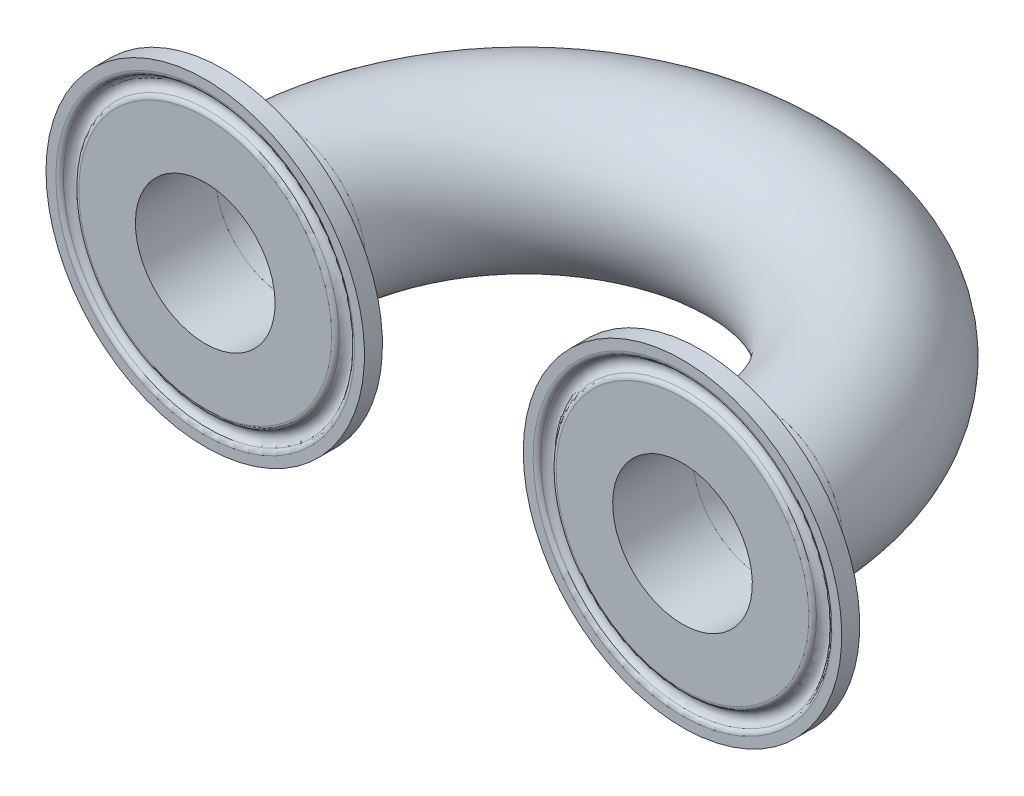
ISO-10303-21;
HEADER;
FILE_DESCRIPTION(('STEP AP214'),'2;1');
FILE_NAME('part.step','',(''),(''),'','','');
FILE_SCHEMA(('AUTOMOTIVE_DESIGN { 1 0 10303 214 1 1 1 1 }'));
ENDSEC;
DATA;
#1=APPLICATION_CONTEXT('core data for automotive mechanical design processes');
#2=APPLICATION_PROTOCOL_DEFINITION('international standard','automotive_design',2000,#1);
#3=PRODUCT_CONTEXT('',#1,'mechanical');
#4=PRODUCT('Part','Part','',(#3));
#5=PRODUCT_RELATED_PRODUCT_CATEGORY('part','',(#4));
#6=PRODUCT_DEFINITION_FORMATION('','',#4);
#7=PRODUCT_DEFINITION_CONTEXT('part definition',#1,'design');
#8=PRODUCT_DEFINITION('design','',#6,#7);
#9=PRODUCT_DEFINITION_SHAPE('','',#8);
#10=(LENGTH_UNIT() NAMED_UNIT(*) SI_UNIT(.MILLI.,.METRE.));
#11=(NAMED_UNIT(*) PLANE_ANGLE_UNIT() SI_UNIT($,.RADIAN.));
#12=(NAMED_UNIT(*) SI_UNIT($,.STERADIAN.) SOLID_ANGLE_UNIT());
#13=UNCERTAINTY_MEASURE_WITH_UNIT(LENGTH_MEASURE(1.E-05),#10,'distance_accuracy_value','');
#14=(GEOMETRIC_REPRESENTATION_CONTEXT(3) GLOBAL_UNCERTAINTY_ASSIGNED_CONTEXT((#13)) GLOBAL_UNIT_ASSIGNED_CONTEXT((#10,
#11,#12)) REPRESENTATION_CONTEXT('',''));
#15=CARTESIAN_POINT('',(0.,0.,0.));
#16=DIRECTION('',(0.,0.,1.));
#17=DIRECTION('',(1.,0.,0.));
#18=AXIS2_PLACEMENT_3D('',#15,#16,#17);
#19=CARTESIAN_POINT('',(69.8077252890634,44.4611890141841,78.8874897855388));
#20=DIRECTION('',(0.,0.,1.));
#21=DIRECTION('',(0.580071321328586,-0.814565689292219,0.));
#22=AXIS2_PLACEMENT_3D('',#19,#20,#21);
#23=TOROIDAL_SURFACE('',#22,23.6366084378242,0.787399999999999);
#24=CARTESIAN_POINT('',(69.8077252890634,44.4611890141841,79.6748897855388));
#25=DIRECTION('',(0.,0.,1.));
#26=DIRECTION('',(0.580071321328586,-0.814565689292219,0.));
#27=AXIS2_PLACEMENT_3D('',#24,#25,#26);
#28=CIRCLE('',#27,23.6366084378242);
#29=CARTESIAN_POINT('',(83.5186439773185,25.2076187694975,79.6748897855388));
#30=VERTEX_POINT('',#29);
#31=EDGE_CURVE('P0_E48',#30,#30,#28,.T.);
#32=ORIENTED_EDGE('',*,*,#31,.T.);
#33=EDGE_LOOP('',(#32));
#34=FACE_BOUND('',#33,.T.);
#35=CARTESIAN_POINT('',(69.8077252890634,44.4611890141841,79.2004308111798));
#36=DIRECTION('',(0.,0.,1.));
#37=DIRECTION('',(0.580071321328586,-0.814565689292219,0.));
#38=AXIS2_PLACEMENT_3D('',#35,#36,#37);
#39=CIRCLE('',#38,22.9140666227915);
#40=CARTESIAN_POINT('',(83.0995181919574,25.7961765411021,79.2004308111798));
#41=VERTEX_POINT('',#40);
#42=EDGE_CURVE('P0_E9',#41,#41,#39,.T.);
#43=ORIENTED_EDGE('',*,*,#42,.F.);
#44=EDGE_LOOP('',(#43));
#45=FACE_BOUND('',#44,.T.);
#46=ADVANCED_FACE('P0_F14',(#34,#45),#23,.T.);
#47=CARTESIAN_POINT('',(69.8077252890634,44.4611890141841,79.6748897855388));
#48=DIRECTION('',(0.,0.,1.));
#49=DIRECTION('',(0.580071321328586,-0.814565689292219,0.));
#50=AXIS2_PLACEMENT_3D('',#47,#48,#49);
#51=TOROIDAL_SURFACE('',#50,21.8186,1.1938);
#52=CARTESIAN_POINT('',(69.8077252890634,44.4611890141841,79.2004308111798));
#53=DIRECTION('',(0.,0.,1.));
#54=DIRECTION('',(0.580071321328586,-0.814565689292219,0.));
#55=AXIS2_PLACEMENT_3D('',#52,#53,#54);
#56=CIRCLE('',#55,20.7231333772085);
#57=CARTESIAN_POINT('',(81.8286206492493,27.5808355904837,79.2004308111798));
#58=VERTEX_POINT('',#57);
#59=EDGE_CURVE('P0_E20',#58,#58,#56,.T.);
#60=ORIENTED_EDGE('',*,*,#59,.F.);
#61=EDGE_LOOP('',(#60));
#62=FACE_BOUND('',#61,.T.);
#63=ORIENTED_EDGE('',*,*,#42,.T.);
#64=EDGE_LOOP('',(#63));
#65=FACE_BOUND('',#64,.T.);
#66=ADVANCED_FACE('P0_F97',(#62,#65),#51,.F.);
#67=CARTESIAN_POINT('',(69.8077252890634,44.4611890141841,78.8874897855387));
#68=DIRECTION('',(0.,0.,1.));
#69=DIRECTION('',(0.580071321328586,-0.814565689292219,0.));
#70=AXIS2_PLACEMENT_3D('',#67,#68,#69);
#71=TOROIDAL_SURFACE('',#70,20.0005915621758,0.787399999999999);
#72=ORIENTED_EDGE('',*,*,#59,.T.);
#73=EDGE_LOOP('',(#72));
#74=FACE_BOUND('',#73,.T.);
#75=CARTESIAN_POINT('',(69.8077252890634,44.4611890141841,79.6748897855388));
#76=DIRECTION('',(0.,0.,1.));
#77=DIRECTION('',(0.580071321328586,-0.814565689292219,0.));
#78=AXIS2_PLACEMENT_3D('',#75,#76,#77);
#79=CIRCLE('',#78,20.0005915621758);
#80=CARTESIAN_POINT('',(81.4094948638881,28.1693933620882,79.6748897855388));
#81=VERTEX_POINT('',#80);
#82=EDGE_CURVE('P0_E24',#81,#81,#79,.T.);
#83=ORIENTED_EDGE('',*,*,#82,.F.);
#84=EDGE_LOOP('',(#83));
#85=FACE_BOUND('',#84,.T.);
#86=ADVANCED_FACE('P0_F93',(#74,#85),#71,.T.);
#87=CARTESIAN_POINT('',(69.8077252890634,44.4611890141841,79.6748897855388));
#88=DIRECTION('',(0.,0.,-1.));
#89=DIRECTION('',(-0.580071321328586,0.814565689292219,0.));
#90=AXIS2_PLACEMENT_3D('',#87,#88,#89);
#91=PLANE('',#90);
#92=CARTESIAN_POINT('',(69.8077252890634,44.4611890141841,79.6748897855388));
#93=DIRECTION('',(0.,0.,1.));
#94=DIRECTION('',(0.580071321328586,-0.814565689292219,0.));
#95=AXIS2_PLACEMENT_3D('',#92,#93,#94);
#96=CIRCLE('',#95,11.049);
#97=CARTESIAN_POINT('',(76.216933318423,35.4610527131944,79.6748897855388));
#98=VERTEX_POINT('',#97);
#99=EDGE_CURVE('P0_E28',#98,#98,#96,.T.);
#100=ORIENTED_EDGE('',*,*,#99,.F.);
#101=EDGE_LOOP('',(#100));
#102=FACE_BOUND('',#101,.T.);
#103=ORIENTED_EDGE('',*,*,#82,.T.);
#104=EDGE_LOOP('',(#103));
#105=FACE_BOUND('',#104,.T.);
#106=ADVANCED_FACE('P0_F86',(#102,#105),#91,.F.);
#107=CARTESIAN_POINT('',(69.8077252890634,44.4611890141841,79.6748897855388));
#108=DIRECTION('',(0.,0.,1.));
#109=DIRECTION('',(0.580071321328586,-0.814565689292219,0.));
#110=AXIS2_PLACEMENT_3D('',#107,#108,#109);
#111=CYLINDRICAL_SURFACE('',#110,11.049);
#112=ORIENTED_EDGE('',*,*,#99,.T.);
#113=EDGE_LOOP('',(#112));
#114=FACE_BOUND('',#113,.T.);
#115=CARTESIAN_POINT('',(69.8077252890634,44.4611890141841,66.9748897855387));
#116=DIRECTION('',(0.,0.,1.));
#117=DIRECTION('',(0.580071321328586,-0.814565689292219,0.));
#118=AXIS2_PLACEMENT_3D('',#115,#116,#117);
#119=CIRCLE('',#118,11.049);
#120=CARTESIAN_POINT('',(76.216933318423,35.4610527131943,66.9748897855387));
#121=VERTEX_POINT('',#120);
#122=EDGE_CURVE('P0_E33',#121,#121,#119,.T.);
#123=ORIENTED_EDGE('',*,*,#122,.F.);
#124=EDGE_LOOP('',(#123));
#125=FACE_BOUND('',#124,.T.);
#126=ADVANCED_FACE('P0_F81',(#114,#125),#111,.F.);
#127=CARTESIAN_POINT('',(69.8077252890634,44.4611890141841,66.9748897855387));
#128=DIRECTION('',(0.,0.,1.));
#129=DIRECTION('',(0.580071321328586,-0.814565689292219,0.));
#130=AXIS2_PLACEMENT_3D('',#127,#128,#129);
#131=PLANE('',#130);
#132=CARTESIAN_POINT('',(69.8077252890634,44.4611890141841,66.9748897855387));
#133=DIRECTION('',(0.,0.,1.));
#134=DIRECTION('',(0.580071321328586,-0.814565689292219,0.));
#135=AXIS2_PLACEMENT_3D('',#132,#133,#134);
#136=CIRCLE('',#135,12.7);
#137=CARTESIAN_POINT('',(77.1746310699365,34.1162047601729,66.9748897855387));
#138=VERTEX_POINT('',#137);
#139=EDGE_CURVE('P0_E36',#138,#138,#136,.T.);
#140=ORIENTED_EDGE('',*,*,#139,.F.);
#141=EDGE_LOOP('',(#140));
#142=FACE_BOUND('',#141,.T.);
#143=ORIENTED_EDGE('',*,*,#122,.T.);
#144=EDGE_LOOP('',(#143));
#145=FACE_BOUND('',#144,.T.);
#146=ADVANCED_FACE('P0_F75',(#142,#145),#131,.F.);
#147=CARTESIAN_POINT('',(69.8077252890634,44.4611890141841,79.6748897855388));
#148=DIRECTION('',(0.,0.,1.));
#149=DIRECTION('',(0.580071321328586,-0.814565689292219,0.));
#150=AXIS2_PLACEMENT_3D('',#147,#148,#149);
#151=CYLINDRICAL_SURFACE('',#150,12.7);
#152=CARTESIAN_POINT('',(69.8077252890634,44.4611890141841,72.2816265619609));
#153=DIRECTION('',(0.,0.,1.));
#154=DIRECTION('',(0.580071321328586,-0.814565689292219,0.));
#155=AXIS2_PLACEMENT_3D('',#152,#153,#154);
#156=CIRCLE('',#155,12.7);
#157=CARTESIAN_POINT('',(77.1746310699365,34.1162047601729,72.2816265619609));
#158=VERTEX_POINT('',#157);
#159=EDGE_CURVE('P0_E39',#158,#158,#156,.T.);
#160=ORIENTED_EDGE('',*,*,#159,.F.);
#161=EDGE_LOOP('',(#160));
#162=FACE_BOUND('',#161,.T.);
#163=ORIENTED_EDGE('',*,*,#139,.T.);
#164=EDGE_LOOP('',(#163));
#165=FACE_BOUND('',#164,.T.);
#166=ADVANCED_FACE('P0_F69',(#162,#165),#151,.T.);
#167=CARTESIAN_POINT('',(69.8077252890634,44.4611890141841,72.2816265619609));
#168=DIRECTION('',(0.,0.,1.));
#169=DIRECTION('',(0.580071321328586,-0.814565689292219,0.));
#170=AXIS2_PLACEMENT_3D('',#167,#168,#169);
#171=CONICAL_SURFACE('',#170,12.7,1.22173047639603);
#172=CARTESIAN_POINT('',(69.8077252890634,44.4611890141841,76.8300897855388));
#173=DIRECTION('',(0.,0.,1.));
#174=DIRECTION('',(0.580071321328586,-0.814565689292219,0.));
#175=AXIS2_PLACEMENT_3D('',#172,#173,#174);
#176=CIRCLE('',#175,25.1968);
#177=CARTESIAN_POINT('',(84.4236663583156,23.9367402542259,76.8300897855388));
#178=VERTEX_POINT('',#177);
#179=EDGE_CURVE('P0_E42',#178,#178,#176,.T.);
#180=ORIENTED_EDGE('',*,*,#179,.F.);
#181=EDGE_LOOP('',(#180));
#182=FACE_BOUND('',#181,.T.);
#183=ORIENTED_EDGE('',*,*,#159,.T.);
#184=EDGE_LOOP('',(#183));
#185=FACE_BOUND('',#184,.T.);
#186=ADVANCED_FACE('P0_F63',(#182,#185),#171,.T.);
#187=CARTESIAN_POINT('',(69.8077252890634,44.4611890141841,79.6748897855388));
#188=DIRECTION('',(0.,0.,1.));
#189=DIRECTION('',(0.580071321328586,-0.814565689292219,0.));
#190=AXIS2_PLACEMENT_3D('',#187,#188,#189);
#191=CYLINDRICAL_SURFACE('',#190,25.1968);
#192=CARTESIAN_POINT('',(69.8077252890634,44.4611890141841,79.6748897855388));
#193=DIRECTION('',(0.,0.,1.));
#194=DIRECTION('',(0.580071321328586,-0.814565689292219,0.));
#195=AXIS2_PLACEMENT_3D('',#192,#193,#194);
#196=CIRCLE('',#195,25.1968);
#197=CARTESIAN_POINT('',(84.4236663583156,23.9367402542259,79.6748897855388));
#198=VERTEX_POINT('',#197);
#199=EDGE_CURVE('P0_E45',#198,#198,#196,.T.);
#200=ORIENTED_EDGE('',*,*,#199,.F.);
#201=EDGE_LOOP('',(#200));
#202=FACE_BOUND('',#201,.T.);
#203=ORIENTED_EDGE('',*,*,#179,.T.);
#204=EDGE_LOOP('',(#203));
#205=FACE_BOUND('',#204,.T.);
#206=ADVANCED_FACE('P0_F57',(#202,#205),#191,.T.);
#207=CARTESIAN_POINT('',(69.8077252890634,44.4611890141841,79.6748897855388));
#208=DIRECTION('',(0.,0.,-1.));
#209=DIRECTION('',(-0.580071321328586,0.814565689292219,0.));
#210=AXIS2_PLACEMENT_3D('',#207,#208,#209);
#211=PLANE('',#210);
#212=ORIENTED_EDGE('',*,*,#31,.F.);
#213=EDGE_LOOP('',(#212));
#214=FACE_BOUND('',#213,.T.);
#215=ORIENTED_EDGE('',*,*,#199,.T.);
#216=EDGE_LOOP('',(#215));
#217=FACE_BOUND('',#216,.T.);
#218=ADVANCED_FACE('P0_F54',(#214,#217),#211,.F.);
#219=CLOSED_SHELL('',(#46,#66,#86,#106,#126,#146,#166,#186,#206,#218));
#220=MANIFOLD_SOLID_BREP('P0_B1',#219);
#221=CARTESIAN_POINT('',(-6.38922202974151,44.4611890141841,78.205419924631));
#222=DIRECTION('',(0.,0.,1.));
#223=DIRECTION('',(0.898456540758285,-0.439062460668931,0.));
#224=AXIS2_PLACEMENT_3D('',#221,#222,#223);
#225=TOROIDAL_SURFACE('',#224,23.6366084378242,0.787399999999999);
#226=CARTESIAN_POINT('',(-6.38922202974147,44.4611890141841,78.992819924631));
#227=DIRECTION('',(0.,0.,1.));
#228=DIRECTION('',(0.898456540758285,-0.439062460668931,0.));
#229=AXIS2_PLACEMENT_3D('',#226,#227,#228);
#230=CIRCLE('',#229,23.6366084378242);
#231=CARTESIAN_POINT('',(14.8472434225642,34.083241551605,78.9928199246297));
#232=VERTEX_POINT('',#231);
#233=EDGE_CURVE('P1_E49',#232,#232,#230,.T.);
#234=ORIENTED_EDGE('',*,*,#233,.T.);
#235=EDGE_LOOP('',(#234));
#236=FACE_BOUND('',#235,.T.);
#237=CARTESIAN_POINT('',(-6.38922202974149,44.4611890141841,78.518360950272));
#238=DIRECTION('',(0.,0.,1.));
#239=DIRECTION('',(0.898456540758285,-0.439062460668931,0.));
#240=AXIS2_PLACEMENT_3D('',#237,#238,#239);
#241=CIRCLE('',#240,22.9140666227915);
#242=CARTESIAN_POINT('',(14.1980710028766,34.4004825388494,78.5183609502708));
#243=VERTEX_POINT('',#242);
#244=EDGE_CURVE('P1_E10',#243,#243,#241,.T.);
#245=ORIENTED_EDGE('',*,*,#244,.F.);
#246=EDGE_LOOP('',(#245));
#247=FACE_BOUND('',#246,.T.);
#248=ADVANCED_FACE('P1_F15',(#236,#247),#225,.T.);
#249=CARTESIAN_POINT('',(-6.38922202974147,44.4611890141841,78.992819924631));
#250=DIRECTION('',(0.,0.,1.));
#251=DIRECTION('',(0.898456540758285,-0.439062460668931,0.));
#252=AXIS2_PLACEMENT_3D('',#249,#250,#251);
#253=TOROIDAL_SURFACE('',#252,21.8186,1.1938);
#254=CARTESIAN_POINT('',(-6.38922202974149,44.4611890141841,78.518360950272));
#255=DIRECTION('',(0.,0.,1.));
#256=DIRECTION('',(0.898456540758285,-0.439062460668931,0.));
#257=AXIS2_PLACEMENT_3D('',#254,#255,#256);
#258=CIRCLE('',#257,20.7231333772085);
#259=CARTESIAN_POINT('',(12.2296126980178,35.3624390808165,78.5183609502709));
#260=VERTEX_POINT('',#259);
#261=EDGE_CURVE('P1_E21',#260,#260,#258,.T.);
#262=ORIENTED_EDGE('',*,*,#261,.F.);
#263=EDGE_LOOP('',(#262));
#264=FACE_BOUND('',#263,.T.);
#265=ORIENTED_EDGE('',*,*,#244,.T.);
#266=EDGE_LOOP('',(#265));
#267=FACE_BOUND('',#266,.T.);
#268=ADVANCED_FACE('P1_F98',(#264,#267),#253,.F.);
#269=CARTESIAN_POINT('',(-6.38922202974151,44.4611890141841,78.205419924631));
#270=DIRECTION('',(0.,0.,1.));
#271=DIRECTION('',(0.898456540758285,-0.439062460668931,0.));
#272=AXIS2_PLACEMENT_3D('',#269,#270,#271);
#273=TOROIDAL_SURFACE('',#272,20.0005915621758,0.787399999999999);
#274=ORIENTED_EDGE('',*,*,#261,.T.);
#275=EDGE_LOOP('',(#274));
#276=FACE_BOUND('',#275,.T.);
#277=CARTESIAN_POINT('',(-6.38922202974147,44.4611890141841,78.992819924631));
#278=DIRECTION('',(0.,0.,1.));
#279=DIRECTION('',(0.898456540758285,-0.439062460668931,0.));
#280=AXIS2_PLACEMENT_3D('',#277,#278,#279);
#281=CIRCLE('',#280,20.0005915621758);
#282=CARTESIAN_POINT('',(11.5804402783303,35.6796800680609,78.9928199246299));
#283=VERTEX_POINT('',#282);
#284=EDGE_CURVE('P1_E25',#283,#283,#281,.T.);
#285=ORIENTED_EDGE('',*,*,#284,.F.);
#286=EDGE_LOOP('',(#285));
#287=FACE_BOUND('',#286,.T.);
#288=ADVANCED_FACE('P1_F94',(#276,#287),#273,.T.);
#289=CARTESIAN_POINT('',(-6.38922202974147,44.4611890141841,78.992819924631));
#290=DIRECTION('',(0.,0.,-1.));
#291=DIRECTION('',(-0.898456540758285,0.439062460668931,0.));
#292=AXIS2_PLACEMENT_3D('',#289,#290,#291);
#293=PLANE('',#292);
#294=CARTESIAN_POINT('',(-6.38922202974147,44.4611890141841,78.992819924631));
#295=DIRECTION('',(0.,0.,1.));
#296=DIRECTION('',(0.898456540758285,-0.439062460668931,0.));
#297=AXIS2_PLACEMENT_3D('',#294,#295,#296);
#298=CIRCLE('',#297,11.049);
#299=CARTESIAN_POINT('',(3.53782428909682,39.6099878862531,78.9928199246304));
#300=VERTEX_POINT('',#299);
#301=EDGE_CURVE('P1_E29',#300,#300,#298,.T.);
#302=ORIENTED_EDGE('',*,*,#301,.F.);
#303=EDGE_LOOP('',(#302));
#304=FACE_BOUND('',#303,.T.);
#305=ORIENTED_EDGE('',*,*,#284,.T.);
#306=EDGE_LOOP('',(#305));
#307=FACE_BOUND('',#306,.T.);
#308=ADVANCED_FACE('P1_F87',(#304,#307),#293,.F.);
#309=CARTESIAN_POINT('',(-6.38922202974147,44.4611890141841,78.992819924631));
#310=DIRECTION('',(0.,0.,1.));
#311=DIRECTION('',(0.898456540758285,-0.439062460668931,0.));
#312=AXIS2_PLACEMENT_3D('',#309,#310,#311);
#313=CYLINDRICAL_SURFACE('',#312,11.049);
#314=ORIENTED_EDGE('',*,*,#301,.T.);
#315=EDGE_LOOP('',(#314));
#316=FACE_BOUND('',#315,.T.);
#317=CARTESIAN_POINT('',(-6.38922202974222,44.4611890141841,66.292819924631));
#318=DIRECTION('',(0.,0.,1.));
#319=DIRECTION('',(0.898456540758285,-0.439062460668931,0.));
#320=AXIS2_PLACEMENT_3D('',#317,#318,#319);
#321=CIRCLE('',#320,11.049);
#322=CARTESIAN_POINT('',(3.53782428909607,39.6099878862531,66.2928199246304));
#323=VERTEX_POINT('',#322);
#324=EDGE_CURVE('P1_E34',#323,#323,#321,.T.);
#325=ORIENTED_EDGE('',*,*,#324,.F.);
#326=EDGE_LOOP('',(#325));
#327=FACE_BOUND('',#326,.T.);
#328=ADVANCED_FACE('P1_F82',(#316,#327),#313,.F.);
#329=CARTESIAN_POINT('',(-6.38922202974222,44.4611890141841,66.292819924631));
#330=DIRECTION('',(0.,0.,1.));
#331=DIRECTION('',(0.898456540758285,-0.439062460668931,0.));
#332=AXIS2_PLACEMENT_3D('',#329,#330,#331);
#333=PLANE('',#332);
#334=CARTESIAN_POINT('',(-6.38922202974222,44.4611890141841,66.292819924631));
#335=DIRECTION('',(0.,0.,1.));
#336=DIRECTION('',(0.898456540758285,-0.439062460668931,0.));
#337=AXIS2_PLACEMENT_3D('',#334,#335,#336);
#338=CIRCLE('',#337,12.7);
#339=CARTESIAN_POINT('',(5.021176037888,38.8850957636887,66.2928199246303));
#340=VERTEX_POINT('',#339);
#341=EDGE_CURVE('P1_E37',#340,#340,#338,.T.);
#342=ORIENTED_EDGE('',*,*,#341,.F.);
#343=EDGE_LOOP('',(#342));
#344=FACE_BOUND('',#343,.T.);
#345=ORIENTED_EDGE('',*,*,#324,.T.);
#346=EDGE_LOOP('',(#345));
#347=FACE_BOUND('',#346,.T.);
#348=ADVANCED_FACE('P1_F76',(#344,#347),#333,.F.);
#349=CARTESIAN_POINT('',(-6.38922202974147,44.4611890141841,78.992819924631));
#350=DIRECTION('',(0.,0.,1.));
#351=DIRECTION('',(0.898456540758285,-0.439062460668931,0.));
#352=AXIS2_PLACEMENT_3D('',#349,#350,#351);
#353=CYLINDRICAL_SURFACE('',#352,12.7);
#354=CARTESIAN_POINT('',(-6.38922202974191,44.4611890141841,71.5995567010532));
#355=DIRECTION('',(0.,0.,1.));
#356=DIRECTION('',(0.898456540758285,-0.439062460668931,0.));
#357=AXIS2_PLACEMENT_3D('',#354,#355,#356);
#358=CIRCLE('',#357,12.7);
#359=CARTESIAN_POINT('',(5.02117603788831,38.8850957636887,71.5995567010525));
#360=VERTEX_POINT('',#359);
#361=EDGE_CURVE('P1_E40',#360,#360,#358,.T.);
#362=ORIENTED_EDGE('',*,*,#361,.F.);
#363=EDGE_LOOP('',(#362));
#364=FACE_BOUND('',#363,.T.);
#365=ORIENTED_EDGE('',*,*,#341,.T.);
#366=EDGE_LOOP('',(#365));
#367=FACE_BOUND('',#366,.T.);
#368=ADVANCED_FACE('P1_F70',(#364,#367),#353,.T.);
#369=CARTESIAN_POINT('',(-6.38922202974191,44.4611890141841,71.5995567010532));
#370=DIRECTION('',(0.,0.,1.));
#371=DIRECTION('',(0.898456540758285,-0.439062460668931,0.));
#372=AXIS2_PLACEMENT_3D('',#369,#370,#371);
#373=CONICAL_SURFACE('',#372,12.7,1.22173047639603);
#374=CARTESIAN_POINT('',(-6.38922202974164,44.4611890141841,76.148019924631));
#375=DIRECTION('',(0.,0.,1.));
#376=DIRECTION('',(0.898456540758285,-0.439062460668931,0.));
#377=AXIS2_PLACEMENT_3D('',#374,#375,#376);
#378=CIRCLE('',#377,25.1968);
#379=CARTESIAN_POINT('',(16.2490077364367,33.3982200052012,76.1480199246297));
#380=VERTEX_POINT('',#379);
#381=EDGE_CURVE('P1_E43',#380,#380,#378,.T.);
#382=ORIENTED_EDGE('',*,*,#381,.F.);
#383=EDGE_LOOP('',(#382));
#384=FACE_BOUND('',#383,.T.);
#385=ORIENTED_EDGE('',*,*,#361,.T.);
#386=EDGE_LOOP('',(#385));
#387=FACE_BOUND('',#386,.T.);
#388=ADVANCED_FACE('P1_F64',(#384,#387),#373,.T.);
#389=CARTESIAN_POINT('',(-6.38922202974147,44.4611890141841,78.992819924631));
#390=DIRECTION('',(0.,0.,1.));
#391=DIRECTION('',(0.898456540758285,-0.439062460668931,0.));
#392=AXIS2_PLACEMENT_3D('',#389,#390,#391);
#393=CYLINDRICAL_SURFACE('',#392,25.1968);
#394=CARTESIAN_POINT('',(-6.38922202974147,44.4611890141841,78.992819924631));
#395=DIRECTION('',(0.,0.,1.));
#396=DIRECTION('',(0.898456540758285,-0.439062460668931,0.));
#397=AXIS2_PLACEMENT_3D('',#394,#395,#396);
#398=CIRCLE('',#397,25.1968);
#399=CARTESIAN_POINT('',(16.2490077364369,33.3982200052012,78.9928199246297));
#400=VERTEX_POINT('',#399);
#401=EDGE_CURVE('P1_E46',#400,#400,#398,.T.);
#402=ORIENTED_EDGE('',*,*,#401,.F.);
#403=EDGE_LOOP('',(#402));
#404=FACE_BOUND('',#403,.T.);
#405=ORIENTED_EDGE('',*,*,#381,.T.);
#406=EDGE_LOOP('',(#405));
#407=FACE_BOUND('',#406,.T.);
#408=ADVANCED_FACE('P1_F58',(#404,#407),#393,.T.);
#409=CARTESIAN_POINT('',(-6.38922202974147,44.4611890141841,78.992819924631));
#410=DIRECTION('',(0.,0.,-1.));
#411=DIRECTION('',(-0.898456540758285,0.439062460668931,0.));
#412=AXIS2_PLACEMENT_3D('',#409,#410,#411);
#413=PLANE('',#412);
#414=ORIENTED_EDGE('',*,*,#233,.F.);
#415=EDGE_LOOP('',(#414));
#416=FACE_BOUND('',#415,.T.);
#417=ORIENTED_EDGE('',*,*,#401,.T.);
#418=EDGE_LOOP('',(#417));
#419=FACE_BOUND('',#418,.T.);
#420=ADVANCED_FACE('P1_F55',(#416,#419),#413,.F.);
#421=CLOSED_SHELL('',(#248,#268,#288,#308,#328,#348,#368,#388,#408,#420));
#422=MANIFOLD_SOLID_BREP('P1_B1',#421);
#423=CARTESIAN_POINT('',(-6.38922202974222,44.4611890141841,66.292819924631));
#424=DIRECTION('',(0.,0.,-1.));
#425=DIRECTION('',(-1.,0.,0.));
#426=AXIS2_PLACEMENT_3D('',#423,#424,#425);
#427=CIRCLE('',#426,12.7);
#428=CARTESIAN_POINT('',(31.7092516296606,44.4611890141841,66.6338548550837));
#429=DIRECTION('',(0.,-1.,0.));
#430=AXIS1_PLACEMENT('',#428,#429);
#431=SURFACE_OF_REVOLUTION('',#427,#430);
#432=CARTESIAN_POINT('',(-19.0892220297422,44.4611890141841,66.2928199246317));
#433=VERTEX_POINT('',#432);
#434=EDGE_CURVE('P2_E10',#433,#433,#427,.T.);
#435=ORIENTED_EDGE('',*,*,#434,.T.);
#436=EDGE_LOOP('',(#435));
#437=FACE_BOUND('',#436,.T.);
#438=CARTESIAN_POINT('',(69.8077252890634,44.4611890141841,66.9748897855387));
#439=DIRECTION('',(0.,0.,1.));
#440=DIRECTION('',(1.,0.,0.));
#441=AXIS2_PLACEMENT_3D('',#438,#439,#440);
#442=CIRCLE('',#441,12.7);
#443=CARTESIAN_POINT('',(82.5077252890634,44.4611890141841,66.9748897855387));
#444=VERTEX_POINT('',#443);
#445=EDGE_CURVE('P2_E22',#444,#444,#442,.T.);
#446=ORIENTED_EDGE('',*,*,#445,.F.);
#447=EDGE_LOOP('',(#446));
#448=FACE_BOUND('',#447,.T.);
#449=ADVANCED_FACE('P2_F15',(#437,#448),#431,.F.);
#450=CARTESIAN_POINT('',(-6.38922202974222,44.4611890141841,66.292819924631));
#451=DIRECTION('',(0.,0.,-1.));
#452=DIRECTION('',(-1.,0.,0.));
#453=AXIS2_PLACEMENT_3D('',#450,#451,#452);
#454=PLANE('',#453);
#455=CARTESIAN_POINT('',(4.65963822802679,44.4611890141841,66.2928199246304));
#456=CARTESIAN_POINT('',(4.65964045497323,44.1507592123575,66.2928199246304));
#457=CARTESIAN_POINT('',(4.64655053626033,43.840365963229,66.2928199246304));
#458=CARTESIAN_POINT('',(4.5942822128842,43.2216820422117,66.2928199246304));
#459=CARTESIAN_POINT('',(4.55509694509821,42.9133919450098,66.2928199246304));
#460=CARTESIAN_POINT('',(4.45085050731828,42.3008815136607,66.2928199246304));
#461=CARTESIAN_POINT('',(4.38576152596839,41.9966659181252,66.2928199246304));
#462=CARTESIAN_POINT('',(4.23017230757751,41.3948036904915,66.2928199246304));
#463=CARTESIAN_POINT('',(4.13967216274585,41.0971570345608,66.2928199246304));
#464=CARTESIAN_POINT('',(3.93395418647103,40.5106938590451,66.2928199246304));
#465=CARTESIAN_POINT('',(3.81874832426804,40.2218731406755,66.2928199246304));
#466=CARTESIAN_POINT('',(3.56441020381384,39.6549604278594,66.2928199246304));
#467=CARTESIAN_POINT('',(3.4252775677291,39.3768686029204,66.2928199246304));
#468=CARTESIAN_POINT('',(3.12411490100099,38.8334657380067,66.2928199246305));
#469=CARTESIAN_POINT('',(2.96209071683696,38.5681514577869,66.2928199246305));
#470=CARTESIAN_POINT('',(2.61627042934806,38.0521147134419,66.2928199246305));
#471=CARTESIAN_POINT('',(2.43247441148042,37.801392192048,66.2928199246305));
#472=CARTESIAN_POINT('',(2.04439843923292,37.3162977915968,66.2928199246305));
#473=CARTESIAN_POINT('',(1.84011660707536,37.0819274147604,66.2928199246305));
#474=CARTESIAN_POINT('',(1.41253508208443,36.6312286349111,66.2928199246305));
#475=CARTESIAN_POINT('',(1.1892353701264,36.4149002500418,66.2928199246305));
#476=CARTESIAN_POINT('',(0.725196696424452,36.0018156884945,66.2928199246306));
#477=CARTESIAN_POINT('',(0.48445705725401,35.805060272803,66.2928199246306));
#478=CARTESIAN_POINT('',(-0.0127421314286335,35.4325302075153,66.2928199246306));
#479=CARTESIAN_POINT('',(-0.269201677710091,35.2567555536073,66.2928199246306));
#480=CARTESIAN_POINT('',(-0.796007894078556,34.9274426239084,66.2928199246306));
#481=CARTESIAN_POINT('',(-1.06635406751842,34.7739035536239,66.2928199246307));
#482=CARTESIAN_POINT('',(-1.61901995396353,34.4901458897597,66.2928199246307));
#483=CARTESIAN_POINT('',(-1.90133966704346,34.3599272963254,66.2928199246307));
#484=CARTESIAN_POINT('',(-2.47594489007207,34.1237365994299,66.2928199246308));
#485=CARTESIAN_POINT('',(-2.7682303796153,34.0177644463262,66.2928199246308));
#486=CARTESIAN_POINT('',(-3.36068971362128,33.8308196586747,66.2928199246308));
#487=CARTESIAN_POINT('',(-3.66086355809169,33.7498470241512,66.2928199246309));
#488=CARTESIAN_POINT('',(-4.26696527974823,33.6134769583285,66.2928199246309));
#489=CARTESIAN_POINT('',(-4.5728931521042,33.5580795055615,66.2928199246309));
#490=CARTESIAN_POINT('',(-5.18832821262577,33.4732534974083,66.2928199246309));
#491=CARTESIAN_POINT('',(-5.49783540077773,33.4438249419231,66.292819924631));
#492=CARTESIAN_POINT('',(-6.11822814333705,33.4111459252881,66.292819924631));
#493=CARTESIAN_POINT('',(-6.42911369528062,33.4078954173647,66.292819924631));
#494=CARTESIAN_POINT('',(-7.05005354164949,33.427595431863,66.292819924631));
#495=CARTESIAN_POINT('',(-7.36010783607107,33.4505459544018,66.2928199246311));
#496=CARTESIAN_POINT('',(-7.97718288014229,33.5224850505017,66.2928199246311));
#497=CARTESIAN_POINT('',(-8.28420361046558,33.5714737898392,66.2928199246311));
#498=CARTESIAN_POINT('',(-8.89302681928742,33.6951411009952,66.2928199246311));
#499=CARTESIAN_POINT('',(-9.19482929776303,33.7698196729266,66.2928199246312));
#500=CARTESIAN_POINT('',(-9.79107073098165,33.9443357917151,66.2928199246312));
#501=CARTESIAN_POINT('',(-10.0855096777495,34.0441733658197,66.2928199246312));
#502=CARTESIAN_POINT('',(-10.6649304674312,34.2682976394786,66.2928199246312));
#503=CARTESIAN_POINT('',(-10.9499123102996,34.3925843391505,66.2928199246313));
#504=CARTESIAN_POINT('',(-11.5083947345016,34.664724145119,66.2928199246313));
#505=CARTESIAN_POINT('',(-11.781895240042,34.8125774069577,66.2928199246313));
#506=CARTESIAN_POINT('',(-12.315468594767,35.13079858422,66.2928199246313));
#507=CARTESIAN_POINT('',(-12.5755414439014,35.3011664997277,66.2928199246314));
#508=CARTESIAN_POINT('',(-13.080410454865,35.6632056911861,66.2928199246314));
#509=CARTESIAN_POINT('',(-13.3252066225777,35.8548769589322,66.2928199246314));
#510=CARTESIAN_POINT('',(-13.7977820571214,36.2581602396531,66.2928199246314));
#511=CARTESIAN_POINT('',(-14.025561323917,36.4697722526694,66.2928199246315));
#512=CARTESIAN_POINT('',(-14.4624846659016,36.9114336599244,66.2928199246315));
#513=CARTESIAN_POINT('',(-14.6716286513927,37.1414831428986,66.2928199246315));
#514=CARTESIAN_POINT('',(-15.0697933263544,37.6183830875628,66.2928199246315));
#515=CARTESIAN_POINT('',(-15.2588140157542,37.865233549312,66.2928199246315));
#516=CARTESIAN_POINT('',(-15.6153883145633,38.3739805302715,66.2928199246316));
#517=CARTESIAN_POINT('',(-15.7829419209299,38.6358770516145,66.2928199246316));
#518=CARTESIAN_POINT('',(-16.0953908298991,39.1728541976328,66.2928199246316));
#519=CARTESIAN_POINT('',(-16.2402861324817,39.4479348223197,66.2928199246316));
#520=CARTESIAN_POINT('',(-16.5063886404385,40.0093251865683,66.2928199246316));
#521=CARTESIAN_POINT('',(-16.6275957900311,40.2956349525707,66.2928199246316));
#522=CARTESIAN_POINT('',(-16.8454598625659,40.8774475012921,66.2928199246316));
#523=CARTESIAN_POINT('',(-16.9421167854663,41.1729502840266,66.2928199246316));
#524=CARTESIAN_POINT('',(-17.1101932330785,41.7710480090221,66.2928199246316));
#525=CARTESIAN_POINT('',(-17.1816127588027,42.0736429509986,66.2928199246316));
#526=CARTESIAN_POINT('',(-17.2987066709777,42.683773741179,66.2928199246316));
#527=CARTESIAN_POINT('',(-17.3443810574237,42.9913095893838,66.2928199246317));
#528=CARTESIAN_POINT('',(-17.4096600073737,43.6091361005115,66.2928199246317));
#529=CARTESIAN_POINT('',(-17.4292645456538,43.9194267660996,66.2928199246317));
#530=CARTESIAN_POINT('',(-17.4422643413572,44.5405566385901,66.2928199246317));
#531=CARTESIAN_POINT('',(-17.435659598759,44.851395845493,66.2928199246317));
#532=CARTESIAN_POINT('',(-17.3962877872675,45.4714129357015,66.2928199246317));
#533=CARTESIAN_POINT('',(-17.363520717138,45.7805908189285,66.2928199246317));
#534=CARTESIAN_POINT('',(-17.272057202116,46.395087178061,66.2928199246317));
#535=CARTESIAN_POINT('',(-17.2133607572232,46.7004056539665,66.2928199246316));
#536=CARTESIAN_POINT('',(-17.0704557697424,47.3050126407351,66.2928199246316));
#537=CARTESIAN_POINT('',(-16.9862472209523,47.6043011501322,66.2928199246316));
#538=CARTESIAN_POINT('',(-16.7929167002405,48.1947203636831,66.2928199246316));
#539=CARTESIAN_POINT('',(-16.6837947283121,48.4858510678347,66.2928199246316));
#540=CARTESIAN_POINT('',(-16.4414131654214,49.0578848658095,66.2928199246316));
#541=CARTESIAN_POINT('',(-16.3081535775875,49.3387879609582,66.2928199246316));
#542=CARTESIAN_POINT('',(-16.0184441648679,49.8883695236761,66.2928199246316));
#543=CARTESIAN_POINT('',(-15.8619943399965,50.1570479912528,66.2928199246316));
#544=CARTESIAN_POINT('',(-15.5270168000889,50.6802700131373,66.2928199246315));
#545=CARTESIAN_POINT('',(-15.3484890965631,50.9348135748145,66.2928199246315));
#546=CARTESIAN_POINT('',(-14.970624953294,51.4279562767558,66.2928199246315));
#547=CARTESIAN_POINT('',(-14.7712885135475,51.6665554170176,66.2928199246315));
#548=CARTESIAN_POINT('',(-14.3532239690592,52.126113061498,66.2928199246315));
#549=CARTESIAN_POINT('',(-14.1344958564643,52.3470715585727,66.2928199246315));
#550=CARTESIAN_POINT('',(-13.6792030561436,52.7697769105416,66.2928199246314));
#551=CARTESIAN_POINT('',(-13.4426383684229,52.9715237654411,66.2928199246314));
#552=CARTESIAN_POINT('',(-12.9533544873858,53.3543713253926,66.2928199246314));
#553=CARTESIAN_POINT('',(-12.7006353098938,53.5354720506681,66.2928199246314));
#554=CARTESIAN_POINT('',(-12.1808389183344,53.8757400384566,66.2928199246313));
#555=CARTESIAN_POINT('',(-11.9137617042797,54.0349073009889,66.2928199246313));
#556=CARTESIAN_POINT('',(-11.3671482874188,54.3301765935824,66.2928199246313));
#557=CARTESIAN_POINT('',(-11.087612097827,54.4662786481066,66.2928199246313));
#558=CARTESIAN_POINT('',(-10.5180678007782,54.7144500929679,66.2928199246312));
#559=CARTESIAN_POINT('',(-10.2280596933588,54.826519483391,66.2928199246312));
#560=CARTESIAN_POINT('',(-9.63963434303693,55.0258284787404,66.2928199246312));
#561=CARTESIAN_POINT('',(-9.34121712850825,55.1130681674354,66.2928199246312));
#562=CARTESIAN_POINT('',(-8.73809419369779,55.2620980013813,66.2928199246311));
#563=CARTESIAN_POINT('',(-8.43338847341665,55.3238881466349,66.2928199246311));
#564=CARTESIAN_POINT('',(-7.81985426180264,55.4215796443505,66.2928199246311));
#565=CARTESIAN_POINT('',(-7.51102576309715,55.4574809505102,66.2928199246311));
#566=CARTESIAN_POINT('',(-6.8914421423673,55.5031393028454,66.292819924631));
#567=CARTESIAN_POINT('',(-6.58068702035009,55.5128963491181,66.292819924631));
#568=CARTESIAN_POINT('',(-5.9594617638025,55.5061967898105,66.2928199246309));
#569=CARTESIAN_POINT('',(-5.64899162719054,55.4897403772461,66.292819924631));
#570=CARTESIAN_POINT('',(-5.03054132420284,55.4307312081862,66.2928199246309));
#571=CARTESIAN_POINT('',(-4.72256115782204,55.3881784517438,66.2928199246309));
#572=CARTESIAN_POINT('',(-4.1112797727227,55.2772789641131,66.2928199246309));
#573=CARTESIAN_POINT('',(-3.80797856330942,55.2089321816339,66.2928199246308));
#574=CARTESIAN_POINT('',(-3.20821206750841,55.0469305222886,66.2928199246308));
#575=CARTESIAN_POINT('',(-2.91174678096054,54.9532756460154,66.2928199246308));
#576=CARTESIAN_POINT('',(-2.32775655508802,54.7413224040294,66.2928199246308));
#577=CARTESIAN_POINT('',(-2.04023171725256,54.6230237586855,66.2928199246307));
#578=CARTESIAN_POINT('',(-1.4761700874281,54.36262464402,66.2928199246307));
#579=CARTESIAN_POINT('',(-1.1996332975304,54.2205241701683,66.2928199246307));
#580=CARTESIAN_POINT('',(-0.659524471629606,53.913537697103,66.2928199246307));
#581=CARTESIAN_POINT('',(-0.395951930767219,53.7486525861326,66.2928199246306));
#582=CARTESIAN_POINT('',(0.116365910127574,53.397265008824,66.2928199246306));
#583=CARTESIAN_POINT('',(0.365111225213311,53.2107625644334,66.2928199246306));
#584=CARTESIAN_POINT('',(0.845979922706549,52.8174878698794,66.2928199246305));
#585=CARTESIAN_POINT('',(1.07810514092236,52.6107178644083,66.2928199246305));
#586=CARTESIAN_POINT('',(1.52411500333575,52.1783596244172,66.2928199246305));
#587=CARTESIAN_POINT('',(1.73799957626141,51.9527713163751,66.2928199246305));
#588=CARTESIAN_POINT('',(2.1460590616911,51.4843207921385,66.2928199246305));
#589=CARTESIAN_POINT('',(2.34022893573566,51.2414541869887,66.2928199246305));
#590=CARTESIAN_POINT('',(2.70741325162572,50.7402293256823,66.2928199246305));
#591=CARTESIAN_POINT('',(2.8804280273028,50.481871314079,66.2928199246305));
#592=CARTESIAN_POINT('',(3.20415521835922,49.9513664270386,66.2928199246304));
#593=CARTESIAN_POINT('',(3.35485663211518,49.6792128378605,66.2928199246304));
#594=CARTESIAN_POINT('',(3.63278326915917,49.1231717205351,66.2928199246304));
#595=CARTESIAN_POINT('',(3.76000840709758,48.8392841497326,66.2928199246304));
#596=CARTESIAN_POINT('',(3.9899533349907,48.2621008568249,66.2928199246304));
#597=CARTESIAN_POINT('',(4.09269932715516,47.9688155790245,66.2928199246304));
#598=CARTESIAN_POINT('',(4.2731062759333,47.374733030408,66.2928199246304));
#599=CARTESIAN_POINT('',(4.35077382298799,47.0739377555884,66.2928199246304));
#600=CARTESIAN_POINT('',(4.49666588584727,46.3912473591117,66.2928199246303));
#601=CARTESIAN_POINT('',(4.55772866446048,46.007800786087,66.2928199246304));
#602=CARTESIAN_POINT('',(4.63921344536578,45.2366134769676,66.2928199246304));
#603=CARTESIAN_POINT('',(4.65963544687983,44.8488727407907,66.2928199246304));
#604=CARTESIAN_POINT('',(4.65963822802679,44.4611890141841,66.2928199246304));
#605=B_SPLINE_CURVE_WITH_KNOTS('',3,(#455,#456,#457,#458,#459,#460,#461,#462,#463,#464,#465,
#466,#467,#468,#469,#470,#471,#472,#473,#474,#475,#476,#477,#478,#479,#480,#481,#482,#483,#484,
#485,#486,#487,#488,#489,#490,#491,#492,#493,#494,#495,#496,#497,#498,#499,#500,#501,#502,#503,
#504,#505,#506,#507,#508,#509,#510,#511,#512,#513,#514,#515,#516,#517,#518,#519,#520,#521,#522,
#523,#524,#525,#526,#527,#528,#529,#530,#531,#532,#533,#534,#535,#536,#537,#538,#539,#540,#541,
#542,#543,#544,#545,#546,#547,#548,#549,#550,#551,#552,#553,#554,#555,#556,#557,#558,#559,#560,
#561,#562,#563,#564,#565,#566,#567,#568,#569,#570,#571,#572,#573,#574,#575,#576,#577,#578,#579,
#580,#581,#582,#583,#584,#585,#586,#587,#588,#589,#590,#591,#592,#593,#594,#595,#596,#597,#598,
#599,#600,#601,#602,#603,#604),.UNSPECIFIED.,.T.,.F.,(4,2,2,2,2,2,2,2,2,2,2,2,2,2,2,2,2,2,2,2,2,
2,2,2,2,2,2,2,2,2,2,2,2,2,2,2,2,2,2,2,2,2,2,2,2,2,2,2,2,2,2,2,2,2,2,2,2,2,2,2,2,2,2,2,2,2,2,2,2,
2,2,2,2,2,4),(0.,0.930950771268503,1.86214648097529,2.79434467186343,3.72653948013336,
4.65828368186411,5.590042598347,6.52156397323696,7.45308169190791,8.38468487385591,
9.31628899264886,10.2479293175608,11.1795694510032,12.1111762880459,13.0427831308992,
13.9743880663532,14.9059930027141,15.8375971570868,16.7692013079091,17.7008037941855,
18.6324062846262,19.5640147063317,20.4956231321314,21.4272325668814,22.3588420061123,
23.2904575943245,24.2220731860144,25.1536884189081,26.0853036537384,27.0169233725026,
27.9485430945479,28.8801629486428,29.8117828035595,30.7434048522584,31.6750269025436,
32.606648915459,33.5382709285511,34.4698938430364,35.4015167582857,36.333139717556,
37.2647626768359,38.1963858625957,39.1280090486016,40.059632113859,40.9912551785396,
41.9228777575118,42.8545003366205,43.7861232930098,44.7177462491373,45.6493682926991,
46.5809903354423,47.5126113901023,48.444232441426,49.375850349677,50.3074682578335,
51.2390878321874,52.1707074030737,53.1023201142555,54.0339328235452,54.9655473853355,
55.8971619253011,56.828787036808,57.7604123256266,58.6920013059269,59.6235893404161,
60.555074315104,61.4865629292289,62.4182890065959,63.350000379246,64.2821696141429,
65.2143422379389,66.1455125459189,67.0764379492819,68.2390661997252,69.4016944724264),.UNSPECIFIED.);
#606=CARTESIAN_POINT('',(4.65963822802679,44.4611890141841,66.2928199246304));
#607=VERTEX_POINT('',#606);
#608=EDGE_CURVE('P2_E26',#607,#607,#605,.T.);
#609=ORIENTED_EDGE('',*,*,#608,.T.);
#610=EDGE_LOOP('',(#609));
#611=FACE_BOUND('',#610,.T.);
#612=ORIENTED_EDGE('',*,*,#434,.F.);
#613=EDGE_LOOP('',(#612));
#614=FACE_BOUND('',#613,.T.);
#615=ADVANCED_FACE('P2_F53',(#611,#614),#454,.F.);
#616=CARTESIAN_POINT('',(69.8077252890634,44.4611890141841,66.9748897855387));
#617=DIRECTION('',(0.,0.,1.));
#618=DIRECTION('',(1.,0.,0.));
#619=AXIS2_PLACEMENT_3D('',#616,#617,#618);
#620=PLANE('',#619);
#621=CARTESIAN_POINT('',(58.7588650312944,44.4611890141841,66.9748897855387));
#622=CARTESIAN_POINT('',(58.758862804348,44.1507592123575,66.9748897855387));
#623=CARTESIAN_POINT('',(58.7719527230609,43.840365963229,66.9748897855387));
#624=CARTESIAN_POINT('',(58.824221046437,43.2216820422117,66.9748897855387));
#625=CARTESIAN_POINT('',(58.863406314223,42.9133919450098,66.9748897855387));
#626=CARTESIAN_POINT('',(58.9676527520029,42.3008815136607,66.9748897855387));
#627=CARTESIAN_POINT('',(59.0327417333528,41.9966659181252,66.9748897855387));
#628=CARTESIAN_POINT('',(59.1883309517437,41.3948036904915,66.9748897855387));
#629=CARTESIAN_POINT('',(59.2788310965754,41.0971570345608,66.9748897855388));
#630=CARTESIAN_POINT('',(59.4845490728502,40.5106938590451,66.9748897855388));
#631=CARTESIAN_POINT('',(59.5997549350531,40.2218731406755,66.9748897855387));
#632=CARTESIAN_POINT('',(59.8540930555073,39.6549604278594,66.9748897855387));
#633=CARTESIAN_POINT('',(59.9932256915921,39.3768686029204,66.9748897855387));
#634=CARTESIAN_POINT('',(60.2943883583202,38.8334657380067,66.9748897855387));
#635=CARTESIAN_POINT('',(60.4564125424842,38.5681514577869,66.9748897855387));
#636=CARTESIAN_POINT('',(60.8022328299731,38.0521147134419,66.9748897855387));
#637=CARTESIAN_POINT('',(60.9860288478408,37.801392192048,66.9748897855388));
#638=CARTESIAN_POINT('',(61.3741048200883,37.3162977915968,66.9748897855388));
#639=CARTESIAN_POINT('',(61.5783866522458,37.0819274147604,66.9748897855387));
#640=CARTESIAN_POINT('',(62.0059681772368,36.6312286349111,66.9748897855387));
#641=CARTESIAN_POINT('',(62.2292678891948,36.4149002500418,66.9748897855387));
#642=CARTESIAN_POINT('',(62.6933065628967,36.0018156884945,66.9748897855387));
#643=CARTESIAN_POINT('',(62.9340462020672,35.805060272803,66.9748897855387));
#644=CARTESIAN_POINT('',(63.4312453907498,35.4325302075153,66.9748897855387));
#645=CARTESIAN_POINT('',(63.6877049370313,35.2567555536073,66.9748897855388));
#646=CARTESIAN_POINT('',(64.2145111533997,34.9274426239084,66.9748897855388));
#647=CARTESIAN_POINT('',(64.4848573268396,34.7739035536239,66.9748897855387));
#648=CARTESIAN_POINT('',(65.0375232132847,34.4901458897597,66.9748897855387));
#649=CARTESIAN_POINT('',(65.3198429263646,34.3599272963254,66.9748897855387));
#650=CARTESIAN_POINT('',(65.8944481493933,34.1237365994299,66.9748897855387));
#651=CARTESIAN_POINT('',(66.1867336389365,34.0177644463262,66.9748897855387));
#652=CARTESIAN_POINT('',(66.7791929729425,33.8308196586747,66.9748897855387));
#653=CARTESIAN_POINT('',(67.0793668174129,33.7498470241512,66.9748897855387));
#654=CARTESIAN_POINT('',(67.6854685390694,33.6134769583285,66.9748897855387));
#655=CARTESIAN_POINT('',(67.9913964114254,33.5580795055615,66.9748897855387));
#656=CARTESIAN_POINT('',(68.606831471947,33.4732534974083,66.9748897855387));
#657=CARTESIAN_POINT('',(68.9163386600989,33.4438249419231,66.9748897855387));
#658=CARTESIAN_POINT('',(69.5367314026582,33.4111459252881,66.9748897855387));
#659=CARTESIAN_POINT('',(69.8476169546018,33.4078954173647,66.9748897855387));
#660=CARTESIAN_POINT('',(70.4685568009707,33.427595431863,66.9748897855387));
#661=CARTESIAN_POINT('',(70.7786110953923,33.4505459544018,66.9748897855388));
#662=CARTESIAN_POINT('',(71.3956861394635,33.5224850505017,66.9748897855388));
#663=CARTESIAN_POINT('',(71.7027068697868,33.5714737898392,66.9748897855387));
#664=CARTESIAN_POINT('',(72.3115300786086,33.6951411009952,66.9748897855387));
#665=CARTESIAN_POINT('',(72.6133325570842,33.7698196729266,66.9748897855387));
#666=CARTESIAN_POINT('',(73.2095739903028,33.9443357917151,66.9748897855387));
#667=CARTESIAN_POINT('',(73.5040129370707,34.0441733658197,66.9748897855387));
#668=CARTESIAN_POINT('',(74.0834337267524,34.2682976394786,66.9748897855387));
#669=CARTESIAN_POINT('',(74.3684155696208,34.3925843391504,66.9748897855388));
#670=CARTESIAN_POINT('',(74.9268979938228,34.664724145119,66.9748897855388));
#671=CARTESIAN_POINT('',(75.2003984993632,34.8125774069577,66.9748897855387));
#672=CARTESIAN_POINT('',(75.7339718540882,35.13079858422,66.9748897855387));
#673=CARTESIAN_POINT('',(75.9940447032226,35.3011664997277,66.9748897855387));
#674=CARTESIAN_POINT('',(76.4989137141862,35.6632056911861,66.9748897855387));
#675=CARTESIAN_POINT('',(76.7437098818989,35.8548769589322,66.9748897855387));
#676=CARTESIAN_POINT('',(77.2162853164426,36.2581602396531,66.9748897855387));
#677=CARTESIAN_POINT('',(77.4440645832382,36.4697722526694,66.9748897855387));
#678=CARTESIAN_POINT('',(77.8809879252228,36.9114336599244,66.9748897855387));
#679=CARTESIAN_POINT('',(78.0901319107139,37.1414831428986,66.9748897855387));
#680=CARTESIAN_POINT('',(78.4882965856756,37.6183830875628,66.9748897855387));
#681=CARTESIAN_POINT('',(78.6773172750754,37.865233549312,66.9748897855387));
#682=CARTESIAN_POINT('',(79.0338915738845,38.3739805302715,66.9748897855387));
#683=CARTESIAN_POINT('',(79.2014451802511,38.6358770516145,66.9748897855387));
#684=CARTESIAN_POINT('',(79.5138940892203,39.1728541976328,66.9748897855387));
#685=CARTESIAN_POINT('',(79.6587893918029,39.4479348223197,66.9748897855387));
#686=CARTESIAN_POINT('',(79.9248918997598,40.0093251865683,66.9748897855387));
#687=CARTESIAN_POINT('',(80.0460990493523,40.2956349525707,66.9748897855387));
#688=CARTESIAN_POINT('',(80.2639631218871,40.8774475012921,66.9748897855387));
#689=CARTESIAN_POINT('',(80.3606200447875,41.1729502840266,66.9748897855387));
#690=CARTESIAN_POINT('',(80.5286964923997,41.7710480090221,66.9748897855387));
#691=CARTESIAN_POINT('',(80.6001160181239,42.0736429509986,66.9748897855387));
#692=CARTESIAN_POINT('',(80.7172099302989,42.683773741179,66.9748897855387));
#693=CARTESIAN_POINT('',(80.7628843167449,42.9913095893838,66.9748897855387));
#694=CARTESIAN_POINT('',(80.8281632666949,43.6091361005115,66.9748897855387));
#695=CARTESIAN_POINT('',(80.847767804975,43.9194267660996,66.9748897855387));
#696=CARTESIAN_POINT('',(80.8607676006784,44.5405566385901,66.9748897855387));
#697=CARTESIAN_POINT('',(80.8541628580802,44.851395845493,66.9748897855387));
#698=CARTESIAN_POINT('',(80.8147910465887,45.4714129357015,66.9748897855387));
#699=CARTESIAN_POINT('',(80.7820239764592,45.7805908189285,66.9748897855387));
#700=CARTESIAN_POINT('',(80.6905604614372,46.395087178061,66.9748897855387));
#701=CARTESIAN_POINT('',(80.6318640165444,46.7004056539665,66.9748897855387));
#702=CARTESIAN_POINT('',(80.4889590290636,47.3050126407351,66.9748897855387));
#703=CARTESIAN_POINT('',(80.4047504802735,47.6043011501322,66.9748897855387));
#704=CARTESIAN_POINT('',(80.2114199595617,48.1947203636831,66.9748897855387));
#705=CARTESIAN_POINT('',(80.1022979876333,48.4858510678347,66.9748897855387));
#706=CARTESIAN_POINT('',(79.8599164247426,49.0578848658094,66.9748897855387));
#707=CARTESIAN_POINT('',(79.7266568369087,49.3387879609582,66.9748897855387));
#708=CARTESIAN_POINT('',(79.4369474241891,49.8883695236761,66.9748897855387));
#709=CARTESIAN_POINT('',(79.2804975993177,50.1570479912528,66.9748897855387));
#710=CARTESIAN_POINT('',(78.9455200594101,50.6802700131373,66.9748897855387));
#711=CARTESIAN_POINT('',(78.7669923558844,50.9348135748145,66.9748897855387));
#712=CARTESIAN_POINT('',(78.3891282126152,51.4279562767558,66.9748897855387));
#713=CARTESIAN_POINT('',(78.1897917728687,51.6665554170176,66.9748897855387));
#714=CARTESIAN_POINT('',(77.7717272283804,52.126113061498,66.9748897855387));
#715=CARTESIAN_POINT('',(77.5529991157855,52.3470715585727,66.9748897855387));
#716=CARTESIAN_POINT('',(77.0977063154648,52.7697769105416,66.9748897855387));
#717=CARTESIAN_POINT('',(76.8611416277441,52.9715237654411,66.9748897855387));
#718=CARTESIAN_POINT('',(76.3718577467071,53.3543713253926,66.9748897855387));
#719=CARTESIAN_POINT('',(76.119138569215,53.5354720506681,66.9748897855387));
#720=CARTESIAN_POINT('',(75.5993421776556,53.8757400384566,66.9748897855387));
#721=CARTESIAN_POINT('',(75.3322649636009,54.0349073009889,66.9748897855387));
#722=CARTESIAN_POINT('',(74.78565154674,54.3301765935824,66.9748897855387));
#723=CARTESIAN_POINT('',(74.5061153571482,54.4662786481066,66.9748897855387));
#724=CARTESIAN_POINT('',(73.9365710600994,54.7144500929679,66.9748897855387));
#725=CARTESIAN_POINT('',(73.64656295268,54.826519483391,66.9748897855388));
#726=CARTESIAN_POINT('',(73.0581376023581,55.0258284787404,66.9748897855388));
#727=CARTESIAN_POINT('',(72.7597203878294,55.1130681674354,66.9748897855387));
#728=CARTESIAN_POINT('',(72.156597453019,55.2620980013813,66.9748897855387));
#729=CARTESIAN_POINT('',(71.8518917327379,55.3238881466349,66.9748897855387));
#730=CARTESIAN_POINT('',(71.2383575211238,55.4215796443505,66.9748897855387));
#731=CARTESIAN_POINT('',(70.9295290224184,55.4574809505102,66.9748897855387));
#732=CARTESIAN_POINT('',(70.3099454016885,55.5031393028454,66.9748897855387));
#733=CARTESIAN_POINT('',(69.9991902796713,55.5128963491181,66.9748897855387));
#734=CARTESIAN_POINT('',(69.3779650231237,55.5061967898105,66.9748897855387));
#735=CARTESIAN_POINT('',(69.0674948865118,55.4897403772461,66.9748897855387));
#736=CARTESIAN_POINT('',(68.4490445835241,55.4307312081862,66.9748897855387));
#737=CARTESIAN_POINT('',(68.1410644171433,55.3881784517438,66.9748897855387));
#738=CARTESIAN_POINT('',(67.5297830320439,55.2772789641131,66.9748897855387));
#739=CARTESIAN_POINT('',(67.2264818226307,55.2089321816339,66.9748897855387));
#740=CARTESIAN_POINT('',(66.6267153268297,55.0469305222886,66.9748897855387));
#741=CARTESIAN_POINT('',(66.3302500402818,54.9532756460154,66.9748897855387));
#742=CARTESIAN_POINT('',(65.7462598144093,54.7413224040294,66.9748897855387));
#743=CARTESIAN_POINT('',(65.4587349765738,54.6230237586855,66.9748897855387));
#744=CARTESIAN_POINT('',(64.8946733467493,54.36262464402,66.9748897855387));
#745=CARTESIAN_POINT('',(64.6181365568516,54.2205241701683,66.9748897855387));
#746=CARTESIAN_POINT('',(64.0780277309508,53.913537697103,66.9748897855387));
#747=CARTESIAN_POINT('',(63.8144551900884,53.7486525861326,66.9748897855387));
#748=CARTESIAN_POINT('',(63.3021373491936,53.397265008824,66.9748897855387));
#749=CARTESIAN_POINT('',(63.0533920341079,53.2107625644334,66.9748897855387));
#750=CARTESIAN_POINT('',(62.5725233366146,52.8174878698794,66.9748897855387));
#751=CARTESIAN_POINT('',(62.3403981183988,52.6107178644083,66.9748897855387));
#752=CARTESIAN_POINT('',(61.8943882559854,52.1783596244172,66.9748897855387));
#753=CARTESIAN_POINT('',(61.6805036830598,51.9527713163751,66.9748897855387));
#754=CARTESIAN_POINT('',(61.2724441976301,51.4843207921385,66.9748897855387));
#755=CARTESIAN_POINT('',(61.0782743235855,51.2414541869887,66.9748897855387));
#756=CARTESIAN_POINT('',(60.7110900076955,50.7402293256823,66.9748897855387));
#757=CARTESIAN_POINT('',(60.5380752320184,50.4818713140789,66.9748897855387));
#758=CARTESIAN_POINT('',(60.214348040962,49.9513664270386,66.9748897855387));
#759=CARTESIAN_POINT('',(60.063646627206,49.6792128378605,66.9748897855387));
#760=CARTESIAN_POINT('',(59.785719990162,49.1231717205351,66.9748897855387));
#761=CARTESIAN_POINT('',(59.6584948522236,48.8392841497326,66.9748897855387));
#762=CARTESIAN_POINT('',(59.4285499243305,48.2621008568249,66.9748897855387));
#763=CARTESIAN_POINT('',(59.325803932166,47.9688155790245,66.9748897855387));
#764=CARTESIAN_POINT('',(59.1453969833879,47.374733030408,66.9748897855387));
#765=CARTESIAN_POINT('',(59.0677294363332,47.0739377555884,66.9748897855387));
#766=CARTESIAN_POINT('',(58.9218373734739,46.3912473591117,66.9748897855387));
#767=CARTESIAN_POINT('',(58.8607745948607,46.0078007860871,66.9748897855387));
#768=CARTESIAN_POINT('',(58.7792898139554,45.2366134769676,66.9748897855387));
#769=CARTESIAN_POINT('',(58.7588678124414,44.8488727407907,66.9748897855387));
#770=CARTESIAN_POINT('',(58.7588650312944,44.4611890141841,66.9748897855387));
#771=B_SPLINE_CURVE_WITH_KNOTS('',3,(#621,#622,#623,#624,#625,#626,#627,#628,#629,#630,#631,
#632,#633,#634,#635,#636,#637,#638,#639,#640,#641,#642,#643,#644,#645,#646,#647,#648,#649,#650,
#651,#652,#653,#654,#655,#656,#657,#658,#659,#660,#661,#662,#663,#664,#665,#666,#667,#668,#669,
#670,#671,#672,#673,#674,#675,#676,#677,#678,#679,#680,#681,#682,#683,#684,#685,#686,#687,#688,
#689,#690,#691,#692,#693,#694,#695,#696,#697,#698,#699,#700,#701,#702,#703,#704,#705,#706,#707,
#708,#709,#710,#711,#712,#713,#714,#715,#716,#717,#718,#719,#720,#721,#722,#723,#724,#725,#726,
#727,#728,#729,#730,#731,#732,#733,#734,#735,#736,#737,#738,#739,#740,#741,#742,#743,#744,#745,
#746,#747,#748,#749,#750,#751,#752,#753,#754,#755,#756,#757,#758,#759,#760,#761,#762,#763,#764,
#765,#766,#767,#768,#769,#770),.UNSPECIFIED.,.T.,.F.,(4,2,2,2,2,2,2,2,2,2,2,2,2,2,2,2,2,2,2,2,2,
2,2,2,2,2,2,2,2,2,2,2,2,2,2,2,2,2,2,2,2,2,2,2,2,2,2,2,2,2,2,2,2,2,2,2,2,2,2,2,2,2,2,2,2,2,2,2,2,
2,2,2,2,2,4),(0.,0.930950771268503,1.86214648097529,2.79434467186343,3.72653948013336,
4.65828368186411,5.59004259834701,6.52156397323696,7.4530816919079,8.38468487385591,
9.31628899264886,10.2479293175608,11.1795694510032,12.1111762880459,13.0427831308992,
13.9743880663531,14.9059930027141,15.8375971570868,16.769201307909,17.7008037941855,
18.6324062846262,19.5640147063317,20.4956231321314,21.4272325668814,22.3588420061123,
23.2904575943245,24.2220731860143,25.1536884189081,26.0853036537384,27.0169233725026,
27.9485430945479,28.8801629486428,29.8117828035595,30.7434048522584,31.6750269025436,
32.606648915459,33.5382709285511,34.4698938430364,35.4015167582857,36.333139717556,
37.2647626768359,38.1963858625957,39.1280090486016,40.059632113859,40.9912551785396,
41.9228777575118,42.8545003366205,43.7861232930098,44.7177462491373,45.6493682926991,
46.5809903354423,47.5126113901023,48.444232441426,49.375850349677,50.3074682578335,
51.2390878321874,52.1707074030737,53.1023201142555,54.0339328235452,54.9655473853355,
55.8971619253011,56.828787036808,57.7604123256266,58.692001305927,59.6235893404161,
60.5550743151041,61.4865629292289,62.4182890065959,63.350000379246,64.2821696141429,
65.2143422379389,66.1455125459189,67.0764379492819,68.2390661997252,69.4016944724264),.UNSPECIFIED.);
#772=CARTESIAN_POINT('',(58.7588650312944,44.4611890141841,66.9748897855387));
#773=VERTEX_POINT('',#772);
#774=EDGE_CURVE('P2_E30',#773,#773,#771,.T.);
#775=ORIENTED_EDGE('',*,*,#774,.F.);
#776=EDGE_LOOP('',(#775));
#777=FACE_BOUND('',#776,.T.);
#778=ORIENTED_EDGE('',*,*,#445,.T.);
#779=EDGE_LOOP('',(#778));
#780=FACE_BOUND('',#779,.T.);
#781=ADVANCED_FACE('P2_F48',(#777,#780),#620,.T.);
#782=CARTESIAN_POINT('',(-6.38922202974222,44.4611890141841,66.292819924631));
#783=DIRECTION('',(0.,0.,-1.));
#784=DIRECTION('',(-1.,0.,0.));
#785=AXIS2_PLACEMENT_3D('',#782,#783,#784);
#786=CIRCLE('',#785,12.7);
#787=CARTESIAN_POINT('',(31.7092516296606,44.4611890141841,66.6338548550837));
#788=DIRECTION('',(0.,-1.,0.));
#789=AXIS1_PLACEMENT('',#787,#788);
#790=SURFACE_OF_REVOLUTION('',#786,#789);
#791=OFFSET_SURFACE('',#790,1.651,.F.);
#792=ORIENTED_EDGE('',*,*,#608,.F.);
#793=EDGE_LOOP('',(#792));
#794=FACE_BOUND('',#793,.T.);
#795=ORIENTED_EDGE('',*,*,#774,.T.);
#796=EDGE_LOOP('',(#795));
#797=FACE_BOUND('',#796,.T.);
#798=ADVANCED_FACE('P2_F43',(#794,#797),#791,.T.);
#799=CLOSED_SHELL('',(#449,#615,#781,#798));
#800=MANIFOLD_SOLID_BREP('P2_B1',#799);
#801=ADVANCED_BREP_SHAPE_REPRESENTATION('',(#18,#220,#422,#800),#14);
#802=SHAPE_DEFINITION_REPRESENTATION(#9,#801);
ENDSEC;
END-ISO-10303-21;
